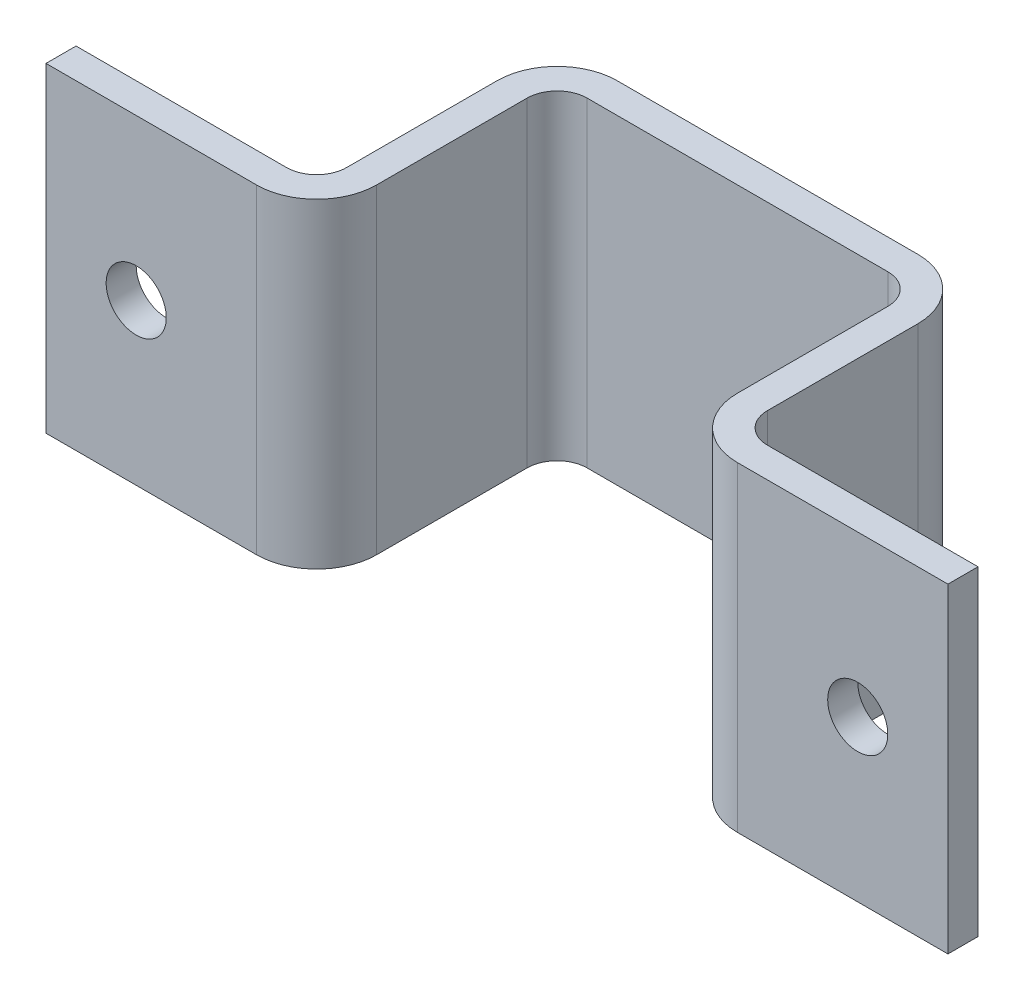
from build123d import *

# Parameters (mm, degrees)
EXTRUDE_THIN1_DEPTH = 26.63484833
SKETCH3_R           = 5
CUT_EXTRUDE1_DEPTH  = 90.075334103
LPATTERN1_COUNT     = 2
LPATTERN1_PITCH     = 120


with BuildPart() as part:
    # Sketch2 → Extrude-Thin1 (new, symmetric)
    with BuildSketch(Plane(origin=(0, 0, 0), x_dir=(1, 0, 0), z_dir=(0, 1, 0))):
        with BuildLine():
            Line((-75, 0), (-40, 0))
            ThreePointArc((-40, 0), (-32.928932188, 2.928932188), (-30, 10))
            Line((-30, 10), (-30, 35))
            ThreePointArc((-30, 35), (-28.535533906, 38.535533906), (-25, 40))
            Line((-25, 40), (25, 40))
            ThreePointArc((25, 40), (28.535533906, 38.535533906), (30, 35))
            Line((30, 35), (30, 10))
            ThreePointArc((30, 10), (32.928932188, 2.928932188), (40, 0))
            Line((40, 0), (75, 0))
            Line((75, 0), (75, 5))
            Line((75, 5), (40, 5))
            ThreePointArc((40, 5), (36.464466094, 6.464466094), (35, 10))
            Line((35, 10), (35, 35))
            ThreePointArc((35, 35), (32.071067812, 42.071067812), (25, 45))
            Line((25, 45), (-25, 45))
            ThreePointArc((-25, 45), (-32.071067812, 42.071067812), (-35, 35))
            Line((-35, 35), (-35, 10))
            ThreePointArc((-35, 10), (-36.464466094, 6.464466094), (-40, 5))
            Line((-40, 5), (-75, 5))
            Line((-75, 5), (-75, 0))
        make_face()
    extrude(amount=EXTRUDE_THIN1_DEPTH, both=True)

    # Sketch3 → Cut-Extrude1 (cut, through all)
    with BuildSketch(Plane(origin=(0, 0, -5), x_dir=(-1, 0, 0), z_dir=(0, 0, -1))):
        with Locations((60, 0)):
            Circle(SKETCH3_R)
    cut_extrude1 = extrude(amount=-CUT_EXTRUDE1_DEPTH, mode=Mode.SUBTRACT)

    # LPattern1: Cut-Extrude1 ×2
    with Locations(*[(i * LPATTERN1_PITCH, 0, 0) for i in range(1, LPATTERN1_COUNT)]):
        add(cut_extrude1, mode=Mode.SUBTRACT)


solid = part.part
